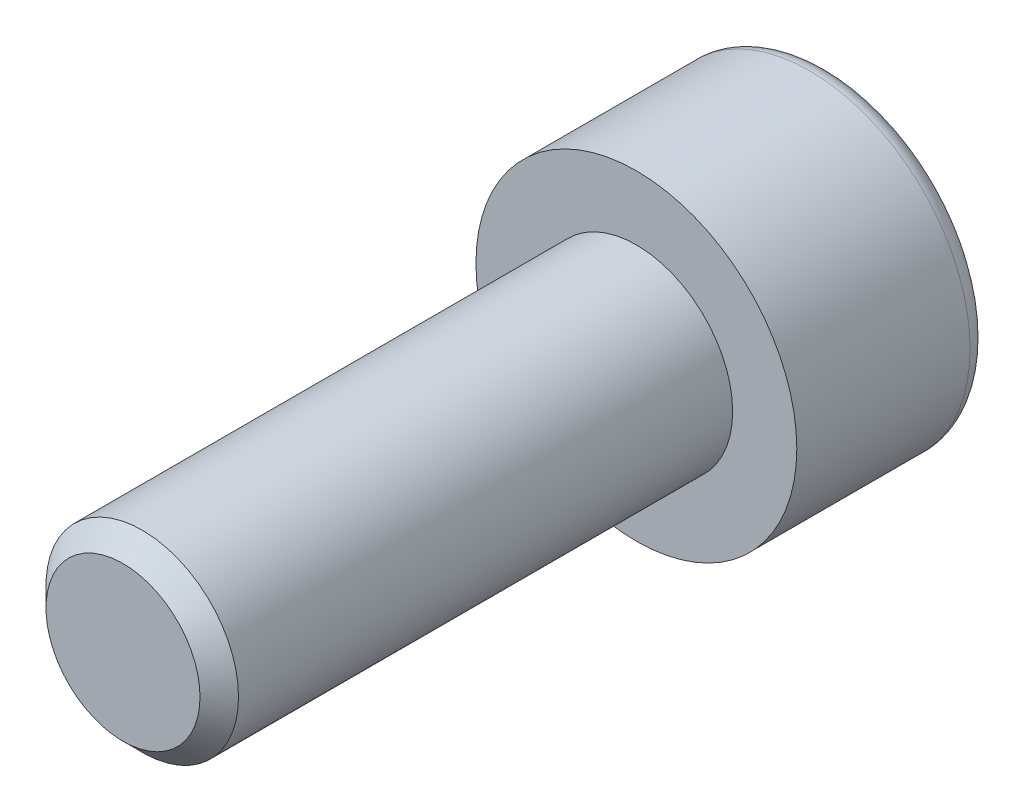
ISO-10303-21;
HEADER;
FILE_DESCRIPTION(('STEP AP214'),'2;1');
FILE_NAME('part.step','',(''),(''),'','','');
FILE_SCHEMA(('AUTOMOTIVE_DESIGN { 1 0 10303 214 1 1 1 1 }'));
ENDSEC;
DATA;
#1=APPLICATION_CONTEXT('core data for automotive mechanical design processes');
#2=APPLICATION_PROTOCOL_DEFINITION('international standard','automotive_design',2000,#1);
#3=PRODUCT_CONTEXT('',#1,'mechanical');
#4=PRODUCT('Part','Part','',(#3));
#5=PRODUCT_RELATED_PRODUCT_CATEGORY('part','',(#4));
#6=PRODUCT_DEFINITION_FORMATION('','',#4);
#7=PRODUCT_DEFINITION_CONTEXT('part definition',#1,'design');
#8=PRODUCT_DEFINITION('design','',#6,#7);
#9=PRODUCT_DEFINITION_SHAPE('','',#8);
#10=(LENGTH_UNIT() NAMED_UNIT(*) SI_UNIT(.MILLI.,.METRE.));
#11=(NAMED_UNIT(*) PLANE_ANGLE_UNIT() SI_UNIT($,.RADIAN.));
#12=(NAMED_UNIT(*) SI_UNIT($,.STERADIAN.) SOLID_ANGLE_UNIT());
#13=UNCERTAINTY_MEASURE_WITH_UNIT(LENGTH_MEASURE(1.E-05),#10,'distance_accuracy_value','');
#14=(GEOMETRIC_REPRESENTATION_CONTEXT(3) GLOBAL_UNCERTAINTY_ASSIGNED_CONTEXT((#13)) GLOBAL_UNIT_ASSIGNED_CONTEXT((#10,
#11,#12)) REPRESENTATION_CONTEXT('',''));
#15=CARTESIAN_POINT('',(0.,0.,0.));
#16=DIRECTION('',(0.,0.,1.));
#17=DIRECTION('',(1.,0.,0.));
#18=AXIS2_PLACEMENT_3D('',#15,#16,#17);
#19=CARTESIAN_POINT('',(0.,0.,-6.));
#20=DIRECTION('',(0.,0.,1.));
#21=DIRECTION('',(1.,0.,0.));
#22=AXIS2_PLACEMENT_3D('',#19,#20,#21);
#23=PLANE('',#22);
#24=CARTESIAN_POINT('',(0.,0.,-6.));
#25=DIRECTION('',(0.,0.,-1.));
#26=DIRECTION('',(-1.,0.,0.));
#27=AXIS2_PLACEMENT_3D('',#24,#25,#26);
#28=CIRCLE('',#27,4.4);
#29=CARTESIAN_POINT('',(-4.4,0.,-6.));
#30=VERTEX_POINT('',#29);
#31=EDGE_CURVE('E134',#30,#30,#28,.T.);
#32=ORIENTED_EDGE('',*,*,#31,.T.);
#33=EDGE_LOOP('',(#32));
#34=FACE_BOUND('',#33,.T.);
#35=DIRECTION('',(-0.86602540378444,0.499999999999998,0.));
#36=VECTOR('',#35,1.);
#37=CARTESIAN_POINT('',(0.,2.88675134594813,-6.));
#38=LINE('',#37,#36);
#39=CARTESIAN_POINT('',(2.5,1.44337567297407,-6.));
#40=VERTEX_POINT('',#39);
#41=CARTESIAN_POINT('',(0.,2.88675134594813,-6.));
#42=VERTEX_POINT('',#41);
#43=EDGE_CURVE('E38',#40,#42,#38,.T.);
#44=ORIENTED_EDGE('',*,*,#43,.T.);
#45=DIRECTION('',(-0.866025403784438,-0.500000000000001,0.));
#46=VECTOR('',#45,1.);
#47=CARTESIAN_POINT('',(0.,2.88675134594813,-6.));
#48=LINE('',#47,#46);
#49=CARTESIAN_POINT('',(-2.5,1.44337567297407,-6.));
#50=VERTEX_POINT('',#49);
#51=EDGE_CURVE('E78',#42,#50,#48,.T.);
#52=ORIENTED_EDGE('',*,*,#51,.T.);
#53=DIRECTION('',(0.,-1.,0.));
#54=VECTOR('',#53,1.);
#55=CARTESIAN_POINT('',(-2.5,-1.44337567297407,-6.));
#56=LINE('',#55,#54);
#57=CARTESIAN_POINT('',(-2.5,-1.44337567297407,-6.));
#58=VERTEX_POINT('',#57);
#59=EDGE_CURVE('E86',#50,#58,#56,.T.);
#60=ORIENTED_EDGE('',*,*,#59,.T.);
#61=DIRECTION('',(0.866025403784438,-0.500000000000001,0.));
#62=VECTOR('',#61,1.);
#63=CARTESIAN_POINT('',(0.,-2.88675134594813,-6.));
#64=LINE('',#63,#62);
#65=CARTESIAN_POINT('',(0.,-2.88675134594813,-6.));
#66=VERTEX_POINT('',#65);
#67=EDGE_CURVE('E104',#58,#66,#64,.T.);
#68=ORIENTED_EDGE('',*,*,#67,.T.);
#69=DIRECTION('',(0.86602540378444,0.499999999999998,0.));
#70=VECTOR('',#69,1.);
#71=CARTESIAN_POINT('',(0.,-2.88675134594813,-6.));
#72=LINE('',#71,#70);
#73=CARTESIAN_POINT('',(2.5,-1.44337567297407,-6.));
#74=VERTEX_POINT('',#73);
#75=EDGE_CURVE('E107',#66,#74,#72,.T.);
#76=ORIENTED_EDGE('',*,*,#75,.T.);
#77=DIRECTION('',(0.,1.,0.));
#78=VECTOR('',#77,1.);
#79=CARTESIAN_POINT('',(2.5,-1.44337567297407,-6.));
#80=LINE('',#79,#78);
#81=EDGE_CURVE('E97',#74,#40,#80,.T.);
#82=ORIENTED_EDGE('',*,*,#81,.T.);
#83=EDGE_LOOP('',(#44,#52,#60,#68,#76,#82));
#84=FACE_BOUND('',#83,.T.);
#85=ADVANCED_FACE('F24',(#34,#84),#23,.F.);
#86=CARTESIAN_POINT('',(0.,0.,-5.4));
#87=DIRECTION('',(0.,0.,-1.));
#88=DIRECTION('',(-1.,0.,0.));
#89=AXIS2_PLACEMENT_3D('',#86,#87,#88);
#90=TOROIDAL_SURFACE('',#89,4.4,0.600000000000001);
#91=ORIENTED_EDGE('',*,*,#31,.F.);
#92=EDGE_LOOP('',(#91));
#93=FACE_BOUND('',#92,.T.);
#94=CARTESIAN_POINT('',(0.,0.,-5.4));
#95=DIRECTION('',(0.,0.,-1.));
#96=DIRECTION('',(-1.,0.,0.));
#97=AXIS2_PLACEMENT_3D('',#94,#95,#96);
#98=CIRCLE('',#97,5.);
#99=CARTESIAN_POINT('',(-5.,0.,-5.4));
#100=VERTEX_POINT('',#99);
#101=EDGE_CURVE('E131',#100,#100,#98,.T.);
#102=ORIENTED_EDGE('',*,*,#101,.T.);
#103=EDGE_LOOP('',(#102));
#104=FACE_BOUND('',#103,.T.);
#105=ADVANCED_FACE('F153',(#93,#104),#90,.T.);
#106=CARTESIAN_POINT('',(0.,0.,0.));
#107=DIRECTION('',(0.,0.,-1.));
#108=DIRECTION('',(-1.,0.,0.));
#109=AXIS2_PLACEMENT_3D('',#106,#107,#108);
#110=CYLINDRICAL_SURFACE('',#109,5.);
#111=ORIENTED_EDGE('',*,*,#101,.F.);
#112=EDGE_LOOP('',(#111));
#113=FACE_BOUND('',#112,.T.);
#114=CARTESIAN_POINT('',(0.,0.,0.));
#115=DIRECTION('',(0.,0.,-1.));
#116=DIRECTION('',(-1.,0.,0.));
#117=AXIS2_PLACEMENT_3D('',#114,#115,#116);
#118=CIRCLE('',#117,5.);
#119=CARTESIAN_POINT('',(-5.,0.,0.));
#120=VERTEX_POINT('',#119);
#121=EDGE_CURVE('E92',#120,#120,#118,.T.);
#122=ORIENTED_EDGE('',*,*,#121,.T.);
#123=EDGE_LOOP('',(#122));
#124=FACE_BOUND('',#123,.T.);
#125=ADVANCED_FACE('F158',(#113,#124),#110,.T.);
#126=CARTESIAN_POINT('',(0.,0.,0.));
#127=DIRECTION('',(0.,0.,-1.));
#128=DIRECTION('',(-1.,0.,0.));
#129=AXIS2_PLACEMENT_3D('',#126,#127,#128);
#130=PLANE('',#129);
#131=CARTESIAN_POINT('',(0.,0.,0.));
#132=DIRECTION('',(0.,0.,1.));
#133=DIRECTION('',(1.,0.,0.));
#134=AXIS2_PLACEMENT_3D('',#131,#132,#133);
#135=CIRCLE('',#134,3.);
#136=CARTESIAN_POINT('',(3.,0.,0.));
#137=VERTEX_POINT('',#136);
#138=EDGE_CURVE('E98',#137,#137,#135,.T.);
#139=ORIENTED_EDGE('',*,*,#138,.F.);
#140=EDGE_LOOP('',(#139));
#141=FACE_BOUND('',#140,.T.);
#142=ORIENTED_EDGE('',*,*,#121,.F.);
#143=EDGE_LOOP('',(#142));
#144=FACE_BOUND('',#143,.T.);
#145=ADVANCED_FACE('F166',(#141,#144),#130,.F.);
#146=CARTESIAN_POINT('',(0.,2.88675134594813,-3.));
#147=DIRECTION('',(-0.499999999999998,-0.86602540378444,0.));
#148=DIRECTION('',(0.86602540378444,-0.499999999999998,0.));
#149=AXIS2_PLACEMENT_3D('',#146,#147,#148);
#150=PLANE('',#149);
#151=ORIENTED_EDGE('',*,*,#43,.F.);
#152=DIRECTION('',(0.,0.,-1.));
#153=VECTOR('',#152,1.);
#154=CARTESIAN_POINT('',(2.5,1.44337567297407,-3.));
#155=LINE('',#154,#153);
#156=CARTESIAN_POINT('',(2.5,1.44337567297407,-3.));
#157=VERTEX_POINT('',#156);
#158=EDGE_CURVE('E120',#157,#40,#155,.T.);
#159=ORIENTED_EDGE('',*,*,#158,.F.);
#160=DIRECTION('',(-0.86602540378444,0.499999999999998,0.));
#161=VECTOR('',#160,1.);
#162=CARTESIAN_POINT('',(0.,2.88675134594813,-3.));
#163=LINE('',#162,#161);
#164=CARTESIAN_POINT('',(0.,2.88675134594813,-3.));
#165=VERTEX_POINT('',#164);
#166=EDGE_CURVE('E91',#157,#165,#163,.T.);
#167=ORIENTED_EDGE('',*,*,#166,.T.);
#168=DIRECTION('',(0.,0.,-1.));
#169=VECTOR('',#168,1.);
#170=CARTESIAN_POINT('',(0.,2.88675134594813,-3.));
#171=LINE('',#170,#169);
#172=EDGE_CURVE('E80',#165,#42,#171,.T.);
#173=ORIENTED_EDGE('',*,*,#172,.T.);
#174=EDGE_LOOP('',(#151,#159,#167,#173));
#175=FACE_BOUND('',#174,.T.);
#176=ADVANCED_FACE('F89',(#175),#150,.T.);
#177=CARTESIAN_POINT('',(0.,2.88675134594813,-3.));
#178=DIRECTION('',(0.500000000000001,-0.866025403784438,0.));
#179=DIRECTION('',(0.866025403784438,0.500000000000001,0.));
#180=AXIS2_PLACEMENT_3D('',#177,#178,#179);
#181=PLANE('',#180);
#182=ORIENTED_EDGE('',*,*,#51,.F.);
#183=ORIENTED_EDGE('',*,*,#172,.F.);
#184=DIRECTION('',(-0.866025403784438,-0.500000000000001,0.));
#185=VECTOR('',#184,1.);
#186=CARTESIAN_POINT('',(0.,2.88675134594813,-3.));
#187=LINE('',#186,#185);
#188=CARTESIAN_POINT('',(-2.5,1.44337567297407,-3.));
#189=VERTEX_POINT('',#188);
#190=EDGE_CURVE('E111',#165,#189,#187,.T.);
#191=ORIENTED_EDGE('',*,*,#190,.T.);
#192=DIRECTION('',(0.,0.,-1.));
#193=VECTOR('',#192,1.);
#194=CARTESIAN_POINT('',(-2.5,1.44337567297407,-3.));
#195=LINE('',#194,#193);
#196=EDGE_CURVE('E82',#189,#50,#195,.T.);
#197=ORIENTED_EDGE('',*,*,#196,.T.);
#198=EDGE_LOOP('',(#182,#183,#191,#197));
#199=FACE_BOUND('',#198,.T.);
#200=ADVANCED_FACE('F79',(#199),#181,.T.);
#201=CARTESIAN_POINT('',(-2.5,-1.44337567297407,-3.));
#202=DIRECTION('',(1.,0.,0.));
#203=DIRECTION('',(0.,0.,-1.));
#204=AXIS2_PLACEMENT_3D('',#201,#202,#203);
#205=PLANE('',#204);
#206=ORIENTED_EDGE('',*,*,#59,.F.);
#207=ORIENTED_EDGE('',*,*,#196,.F.);
#208=DIRECTION('',(0.,-1.,0.));
#209=VECTOR('',#208,1.);
#210=CARTESIAN_POINT('',(-2.5,-1.44337567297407,-3.));
#211=LINE('',#210,#209);
#212=CARTESIAN_POINT('',(-2.5,-1.44337567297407,-3.));
#213=VERTEX_POINT('',#212);
#214=EDGE_CURVE('E113',#189,#213,#211,.T.);
#215=ORIENTED_EDGE('',*,*,#214,.T.);
#216=DIRECTION('',(0.,0.,-1.));
#217=VECTOR('',#216,1.);
#218=CARTESIAN_POINT('',(-2.5,-1.44337567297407,-3.));
#219=LINE('',#218,#217);
#220=EDGE_CURVE('E126',#213,#58,#219,.T.);
#221=ORIENTED_EDGE('',*,*,#220,.T.);
#222=EDGE_LOOP('',(#206,#207,#215,#221));
#223=FACE_BOUND('',#222,.T.);
#224=ADVANCED_FACE('F181',(#223),#205,.T.);
#225=CARTESIAN_POINT('',(0.,-2.88675134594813,-3.));
#226=DIRECTION('',(0.500000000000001,0.866025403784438,0.));
#227=DIRECTION('',(-0.866025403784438,0.500000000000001,0.));
#228=AXIS2_PLACEMENT_3D('',#225,#226,#227);
#229=PLANE('',#228);
#230=ORIENTED_EDGE('',*,*,#67,.F.);
#231=ORIENTED_EDGE('',*,*,#220,.F.);
#232=DIRECTION('',(0.866025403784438,-0.500000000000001,0.));
#233=VECTOR('',#232,1.);
#234=CARTESIAN_POINT('',(0.,-2.88675134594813,-3.));
#235=LINE('',#234,#233);
#236=CARTESIAN_POINT('',(0.,-2.88675134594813,-3.));
#237=VERTEX_POINT('',#236);
#238=EDGE_CURVE('E115',#213,#237,#235,.T.);
#239=ORIENTED_EDGE('',*,*,#238,.T.);
#240=DIRECTION('',(0.,0.,-1.));
#241=VECTOR('',#240,1.);
#242=CARTESIAN_POINT('',(0.,-2.88675134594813,-3.));
#243=LINE('',#242,#241);
#244=EDGE_CURVE('E124',#237,#66,#243,.T.);
#245=ORIENTED_EDGE('',*,*,#244,.T.);
#246=EDGE_LOOP('',(#230,#231,#239,#245));
#247=FACE_BOUND('',#246,.T.);
#248=ADVANCED_FACE('F184',(#247),#229,.T.);
#249=CARTESIAN_POINT('',(0.,-2.88675134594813,-3.));
#250=DIRECTION('',(-0.499999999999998,0.86602540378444,0.));
#251=DIRECTION('',(-0.86602540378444,-0.499999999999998,0.));
#252=AXIS2_PLACEMENT_3D('',#249,#250,#251);
#253=PLANE('',#252);
#254=ORIENTED_EDGE('',*,*,#75,.F.);
#255=ORIENTED_EDGE('',*,*,#244,.F.);
#256=DIRECTION('',(0.86602540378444,0.499999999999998,0.));
#257=VECTOR('',#256,1.);
#258=CARTESIAN_POINT('',(0.,-2.88675134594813,-3.));
#259=LINE('',#258,#257);
#260=CARTESIAN_POINT('',(2.5,-1.44337567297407,-3.));
#261=VERTEX_POINT('',#260);
#262=EDGE_CURVE('E117',#237,#261,#259,.T.);
#263=ORIENTED_EDGE('',*,*,#262,.T.);
#264=DIRECTION('',(0.,0.,-1.));
#265=VECTOR('',#264,1.);
#266=CARTESIAN_POINT('',(2.5,-1.44337567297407,-3.));
#267=LINE('',#266,#265);
#268=EDGE_CURVE('E122',#261,#74,#267,.T.);
#269=ORIENTED_EDGE('',*,*,#268,.T.);
#270=EDGE_LOOP('',(#254,#255,#263,#269));
#271=FACE_BOUND('',#270,.T.);
#272=ADVANCED_FACE('F188',(#271),#253,.T.);
#273=CARTESIAN_POINT('',(2.5,-1.44337567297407,-3.));
#274=DIRECTION('',(-1.,0.,0.));
#275=DIRECTION('',(0.,0.,1.));
#276=AXIS2_PLACEMENT_3D('',#273,#274,#275);
#277=PLANE('',#276);
#278=ORIENTED_EDGE('',*,*,#81,.F.);
#279=ORIENTED_EDGE('',*,*,#268,.F.);
#280=DIRECTION('',(0.,1.,0.));
#281=VECTOR('',#280,1.);
#282=CARTESIAN_POINT('',(2.5,-1.44337567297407,-3.));
#283=LINE('',#282,#281);
#284=EDGE_CURVE('E45',#261,#157,#283,.T.);
#285=ORIENTED_EDGE('',*,*,#284,.T.);
#286=ORIENTED_EDGE('',*,*,#158,.T.);
#287=EDGE_LOOP('',(#278,#279,#285,#286));
#288=FACE_BOUND('',#287,.T.);
#289=ADVANCED_FACE('F192',(#288),#277,.T.);
#290=CARTESIAN_POINT('',(2.5,1.44337567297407,-3.));
#291=DIRECTION('',(0.,0.,1.));
#292=DIRECTION('',(1.,0.,0.));
#293=AXIS2_PLACEMENT_3D('',#290,#291,#292);
#294=PLANE('',#293);
#295=ORIENTED_EDGE('',*,*,#166,.F.);
#296=ORIENTED_EDGE('',*,*,#284,.F.);
#297=ORIENTED_EDGE('',*,*,#262,.F.);
#298=ORIENTED_EDGE('',*,*,#238,.F.);
#299=ORIENTED_EDGE('',*,*,#214,.F.);
#300=ORIENTED_EDGE('',*,*,#190,.F.);
#301=EDGE_LOOP('',(#295,#296,#297,#298,#299,#300));
#302=FACE_BOUND('',#301,.T.);
#303=ADVANCED_FACE('F196',(#302),#294,.F.);
#304=CARTESIAN_POINT('',(0.,0.,16.));
#305=DIRECTION('',(0.,0.,1.));
#306=DIRECTION('',(1.,0.,0.));
#307=AXIS2_PLACEMENT_3D('',#304,#305,#306);
#308=PLANE('',#307);
#309=CARTESIAN_POINT('',(0.,0.,16.));
#310=DIRECTION('',(0.,0.,1.));
#311=DIRECTION('',(1.,0.,0.));
#312=AXIS2_PLACEMENT_3D('',#309,#310,#311);
#313=CIRCLE('',#312,2.4);
#314=CARTESIAN_POINT('',(2.4,0.,16.));
#315=VERTEX_POINT('',#314);
#316=EDGE_CURVE('E31',#315,#315,#313,.T.);
#317=ORIENTED_EDGE('',*,*,#316,.T.);
#318=EDGE_LOOP('',(#317));
#319=FACE_BOUND('',#318,.T.);
#320=ADVANCED_FACE('F139',(#319),#308,.T.);
#321=CARTESIAN_POINT('',(0.,0.,0.));
#322=DIRECTION('',(0.,0.,1.));
#323=DIRECTION('',(1.,0.,0.));
#324=AXIS2_PLACEMENT_3D('',#321,#322,#323);
#325=CYLINDRICAL_SURFACE('',#324,3.);
#326=CARTESIAN_POINT('',(0.,0.,15.4));
#327=DIRECTION('',(0.,0.,1.));
#328=DIRECTION('',(1.,0.,0.));
#329=AXIS2_PLACEMENT_3D('',#326,#327,#328);
#330=CIRCLE('',#329,3.);
#331=CARTESIAN_POINT('',(3.,0.,15.4));
#332=VERTEX_POINT('',#331);
#333=EDGE_CURVE('E11',#332,#332,#330,.F.);
#334=ORIENTED_EDGE('',*,*,#333,.T.);
#335=EDGE_LOOP('',(#334));
#336=FACE_BOUND('',#335,.T.);
#337=ORIENTED_EDGE('',*,*,#138,.T.);
#338=EDGE_LOOP('',(#337));
#339=FACE_BOUND('',#338,.T.);
#340=ADVANCED_FACE('F143',(#336,#339),#325,.T.);
#341=CARTESIAN_POINT('',(0.,0.,16.));
#342=DIRECTION('',(0.,0.,-1.));
#343=DIRECTION('',(-1.,0.,0.));
#344=AXIS2_PLACEMENT_3D('',#341,#342,#343);
#345=CONICAL_SURFACE('',#344,2.4,0.785398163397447);
#346=ORIENTED_EDGE('',*,*,#333,.F.);
#347=EDGE_LOOP('',(#346));
#348=FACE_BOUND('',#347,.T.);
#349=ORIENTED_EDGE('',*,*,#316,.F.);
#350=EDGE_LOOP('',(#349));
#351=FACE_BOUND('',#350,.T.);
#352=ADVANCED_FACE('F141',(#348,#351),#345,.T.);
#353=CLOSED_SHELL('',(#85,#105,#125,#145,#176,#200,#224,#248,#272,#289,#303,#320,#340,#352));
#354=MANIFOLD_SOLID_BREP('B2',#353);
#355=ADVANCED_BREP_SHAPE_REPRESENTATION('',(#18,#354),#14);
#356=SHAPE_DEFINITION_REPRESENTATION(#9,#355);
ENDSEC;
END-ISO-10303-21;
